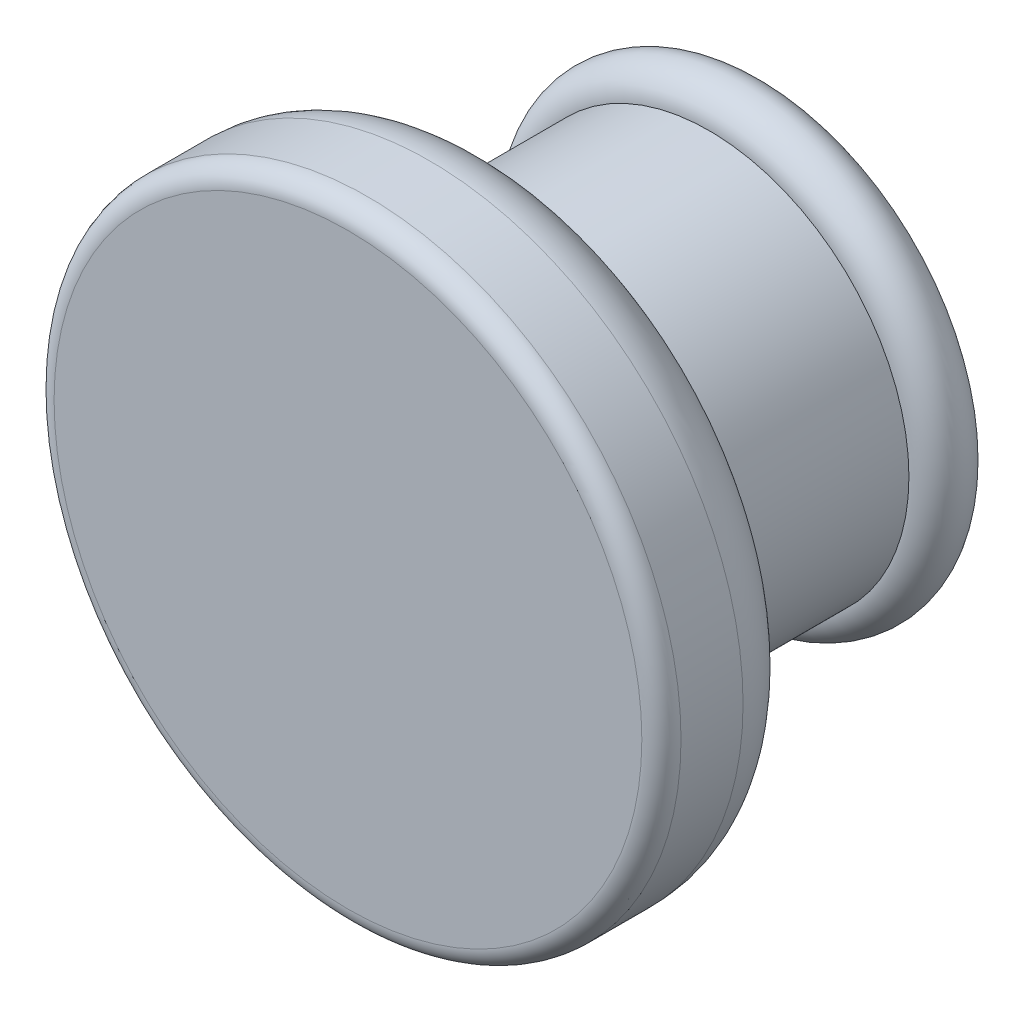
ISO-10303-21;
HEADER;
FILE_DESCRIPTION(('STEP AP214'),'2;1');
FILE_NAME('part.step','',(''),(''),'','','');
FILE_SCHEMA(('AUTOMOTIVE_DESIGN { 1 0 10303 214 1 1 1 1 }'));
ENDSEC;
DATA;
#1=APPLICATION_CONTEXT('core data for automotive mechanical design processes');
#2=APPLICATION_PROTOCOL_DEFINITION('international standard','automotive_design',2000,#1);
#3=PRODUCT_CONTEXT('',#1,'mechanical');
#4=PRODUCT('Part','Part','',(#3));
#5=PRODUCT_RELATED_PRODUCT_CATEGORY('part','',(#4));
#6=PRODUCT_DEFINITION_FORMATION('','',#4);
#7=PRODUCT_DEFINITION_CONTEXT('part definition',#1,'design');
#8=PRODUCT_DEFINITION('design','',#6,#7);
#9=PRODUCT_DEFINITION_SHAPE('','',#8);
#10=(LENGTH_UNIT() NAMED_UNIT(*) SI_UNIT(.MILLI.,.METRE.));
#11=(NAMED_UNIT(*) PLANE_ANGLE_UNIT() SI_UNIT($,.RADIAN.));
#12=(NAMED_UNIT(*) SI_UNIT($,.STERADIAN.) SOLID_ANGLE_UNIT());
#13=UNCERTAINTY_MEASURE_WITH_UNIT(LENGTH_MEASURE(1.E-05),#10,'distance_accuracy_value','');
#14=(GEOMETRIC_REPRESENTATION_CONTEXT(3) GLOBAL_UNCERTAINTY_ASSIGNED_CONTEXT((#13)) GLOBAL_UNIT_ASSIGNED_CONTEXT((#10,
#11,#12)) REPRESENTATION_CONTEXT('',''));
#15=CARTESIAN_POINT('',(0.,0.,0.));
#16=DIRECTION('',(0.,0.,1.));
#17=DIRECTION('',(1.,0.,0.));
#18=AXIS2_PLACEMENT_3D('',#15,#16,#17);
#19=CARTESIAN_POINT('',(0.,7.7724,-16.2734315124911));
#20=DIRECTION('',(0.,0.,1.));
#21=DIRECTION('',(1.,0.,0.));
#22=AXIS2_PLACEMENT_3D('',#19,#20,#21);
#23=PLANE('',#22);
#24=CARTESIAN_POINT('',(0.,0.,-16.273431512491));
#25=DIRECTION('',(0.,0.,1.));
#26=DIRECTION('',(1.,0.,0.));
#27=AXIS2_PLACEMENT_3D('',#24,#25,#26);
#28=CIRCLE('',#27,7.7724);
#29=CARTESIAN_POINT('',(7.7724,0.,-16.273431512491));
#30=VERTEX_POINT('',#29);
#31=EDGE_CURVE('E133',#30,#30,#28,.T.);
#32=ORIENTED_EDGE('',*,*,#31,.F.);
#33=EDGE_LOOP('',(#32));
#34=FACE_BOUND('',#33,.T.);
#35=ADVANCED_FACE('F14',(#34),#23,.F.);
#36=CARTESIAN_POINT('',(0.,0.,-15.1598157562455));
#37=DIRECTION('',(0.,0.,1.));
#38=DIRECTION('',(1.,0.,0.));
#39=AXIS2_PLACEMENT_3D('',#36,#37,#38);
#40=TOROIDAL_SURFACE('',#39,7.7724,1.11361575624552);
#41=CARTESIAN_POINT('',(0.,0.,-14.0462));
#42=DIRECTION('',(0.,0.,1.));
#43=DIRECTION('',(1.,0.,0.));
#44=AXIS2_PLACEMENT_3D('',#41,#42,#43);
#45=CIRCLE('',#44,7.7724);
#46=CARTESIAN_POINT('',(7.7724,0.,-14.0462));
#47=VERTEX_POINT('',#46);
#48=EDGE_CURVE('E125',#47,#47,#45,.T.);
#49=ORIENTED_EDGE('',*,*,#48,.F.);
#50=EDGE_LOOP('',(#49));
#51=FACE_BOUND('',#50,.T.);
#52=ORIENTED_EDGE('',*,*,#31,.T.);
#53=EDGE_LOOP('',(#52));
#54=FACE_BOUND('',#53,.T.);
#55=ADVANCED_FACE('F140',(#51,#54),#40,.T.);
#56=CARTESIAN_POINT('',(0.,0.,-24.4602));
#57=DIRECTION('',(0.,0.,1.));
#58=DIRECTION('',(1.,0.,0.));
#59=AXIS2_PLACEMENT_3D('',#56,#57,#58);
#60=CYLINDRICAL_SURFACE('',#59,7.7724);
#61=CARTESIAN_POINT('',(0.,0.,-5.969));
#62=DIRECTION('',(0.,0.,1.));
#63=DIRECTION('',(1.,0.,0.));
#64=AXIS2_PLACEMENT_3D('',#61,#62,#63);
#65=CIRCLE('',#64,7.7724);
#66=CARTESIAN_POINT('',(7.7724,0.,-5.969));
#67=VERTEX_POINT('',#66);
#68=EDGE_CURVE('E112',#67,#67,#65,.F.);
#69=ORIENTED_EDGE('',*,*,#68,.T.);
#70=EDGE_LOOP('',(#69));
#71=FACE_BOUND('',#70,.T.);
#72=ORIENTED_EDGE('',*,*,#48,.T.);
#73=EDGE_LOOP('',(#72));
#74=FACE_BOUND('',#73,.T.);
#75=ADVANCED_FACE('F118',(#71,#74),#60,.T.);
#76=CARTESIAN_POINT('',(0.,0.,-5.969));
#77=DIRECTION('',(0.,0.,1.));
#78=DIRECTION('',(1.,0.,0.));
#79=AXIS2_PLACEMENT_3D('',#76,#77,#78);
#80=TOROIDAL_SURFACE('',#79,8.0264,0.254);
#81=ORIENTED_EDGE('',*,*,#68,.F.);
#82=EDGE_LOOP('',(#81));
#83=FACE_BOUND('',#82,.T.);
#84=CARTESIAN_POINT('',(0.,0.,-5.715));
#85=DIRECTION('',(0.,0.,-1.));
#86=DIRECTION('',(1.,0.,0.));
#87=AXIS2_PLACEMENT_3D('',#84,#85,#86);
#88=CIRCLE('',#87,8.0264);
#89=CARTESIAN_POINT('',(8.0264,0.,-5.715));
#90=VERTEX_POINT('',#89);
#91=EDGE_CURVE('E92',#90,#90,#88,.T.);
#92=ORIENTED_EDGE('',*,*,#91,.T.);
#93=EDGE_LOOP('',(#92));
#94=FACE_BOUND('',#93,.T.);
#95=ADVANCED_FACE('F114',(#83,#94),#80,.F.);
#96=CARTESIAN_POINT('',(0.,0.,-5.715));
#97=DIRECTION('',(0.,0.,1.));
#98=DIRECTION('',(1.,0.,0.));
#99=AXIS2_PLACEMENT_3D('',#96,#97,#98);
#100=PLANE('',#99);
#101=ORIENTED_EDGE('',*,*,#91,.F.);
#102=EDGE_LOOP('',(#101));
#103=FACE_BOUND('',#102,.T.);
#104=CARTESIAN_POINT('',(0.,0.,-5.715));
#105=DIRECTION('',(0.,0.,1.));
#106=DIRECTION('',(1.,0.,0.));
#107=AXIS2_PLACEMENT_3D('',#104,#105,#106);
#108=CIRCLE('',#107,9.652);
#109=CARTESIAN_POINT('',(9.652,0.,-5.715));
#110=VERTEX_POINT('',#109);
#111=EDGE_CURVE('E33',#110,#110,#108,.T.);
#112=ORIENTED_EDGE('',*,*,#111,.F.);
#113=EDGE_LOOP('',(#112));
#114=FACE_BOUND('',#113,.T.);
#115=ADVANCED_FACE('F68',(#103,#114),#100,.F.);
#116=CARTESIAN_POINT('',(0.,0.,-3.175));
#117=DIRECTION('',(0.,0.,1.));
#118=DIRECTION('',(1.,0.,0.));
#119=AXIS2_PLACEMENT_3D('',#116,#117,#118);
#120=TOROIDAL_SURFACE('',#119,9.652,2.54);
#121=CARTESIAN_POINT('',(0.,0.,-3.175));
#122=DIRECTION('',(0.,0.,1.));
#123=DIRECTION('',(1.,0.,0.));
#124=AXIS2_PLACEMENT_3D('',#121,#122,#123);
#125=CIRCLE('',#124,12.192);
#126=CARTESIAN_POINT('',(12.192,0.,-3.175));
#127=VERTEX_POINT('',#126);
#128=EDGE_CURVE('E28',#127,#127,#125,.T.);
#129=ORIENTED_EDGE('',*,*,#128,.F.);
#130=EDGE_LOOP('',(#129));
#131=FACE_BOUND('',#130,.T.);
#132=ORIENTED_EDGE('',*,*,#111,.T.);
#133=EDGE_LOOP('',(#132));
#134=FACE_BOUND('',#133,.T.);
#135=ADVANCED_FACE('F62',(#131,#134),#120,.T.);
#136=CARTESIAN_POINT('',(0.,0.,-5.715));
#137=DIRECTION('',(0.,0.,1.));
#138=DIRECTION('',(1.,0.,0.));
#139=AXIS2_PLACEMENT_3D('',#136,#137,#138);
#140=CYLINDRICAL_SURFACE('',#139,12.192);
#141=CARTESIAN_POINT('',(0.,0.,-0.762));
#142=DIRECTION('',(0.,0.,1.));
#143=DIRECTION('',(1.,0.,0.));
#144=AXIS2_PLACEMENT_3D('',#141,#142,#143);
#145=CIRCLE('',#144,12.192);
#146=CARTESIAN_POINT('',(12.192,0.,-0.762));
#147=VERTEX_POINT('',#146);
#148=EDGE_CURVE('E23',#147,#147,#145,.T.);
#149=ORIENTED_EDGE('',*,*,#148,.F.);
#150=EDGE_LOOP('',(#149));
#151=FACE_BOUND('',#150,.T.);
#152=ORIENTED_EDGE('',*,*,#128,.T.);
#153=EDGE_LOOP('',(#152));
#154=FACE_BOUND('',#153,.T.);
#155=ADVANCED_FACE('F58',(#151,#154),#140,.T.);
#156=CARTESIAN_POINT('',(0.,0.,-0.762));
#157=DIRECTION('',(0.,0.,1.));
#158=DIRECTION('',(1.,0.,0.));
#159=AXIS2_PLACEMENT_3D('',#156,#157,#158);
#160=TOROIDAL_SURFACE('',#159,11.43,0.762);
#161=CARTESIAN_POINT('',(0.,0.,0.));
#162=DIRECTION('',(0.,0.,-1.));
#163=DIRECTION('',(1.,0.,0.));
#164=AXIS2_PLACEMENT_3D('',#161,#162,#163);
#165=CIRCLE('',#164,11.43);
#166=CARTESIAN_POINT('',(11.43,0.,0.));
#167=VERTEX_POINT('',#166);
#168=EDGE_CURVE('E10',#167,#167,#165,.F.);
#169=ORIENTED_EDGE('',*,*,#168,.F.);
#170=EDGE_LOOP('',(#169));
#171=FACE_BOUND('',#170,.T.);
#172=ORIENTED_EDGE('',*,*,#148,.T.);
#173=EDGE_LOOP('',(#172));
#174=FACE_BOUND('',#173,.T.);
#175=ADVANCED_FACE('F47',(#171,#174),#160,.T.);
#176=CARTESIAN_POINT('',(0.,0.,0.));
#177=DIRECTION('',(0.,0.,1.));
#178=DIRECTION('',(1.,0.,0.));
#179=AXIS2_PLACEMENT_3D('',#176,#177,#178);
#180=PLANE('',#179);
#181=ORIENTED_EDGE('',*,*,#168,.T.);
#182=EDGE_LOOP('',(#181));
#183=FACE_BOUND('',#182,.T.);
#184=ADVANCED_FACE('F57',(#183),#180,.T.);
#185=CLOSED_SHELL('',(#35,#55,#75,#95,#115,#135,#155,#175,#184));
#186=MANIFOLD_SOLID_BREP('B1',#185);
#187=ADVANCED_BREP_SHAPE_REPRESENTATION('',(#18,#186),#14);
#188=SHAPE_DEFINITION_REPRESENTATION(#9,#187);
ENDSEC;
END-ISO-10303-21;
